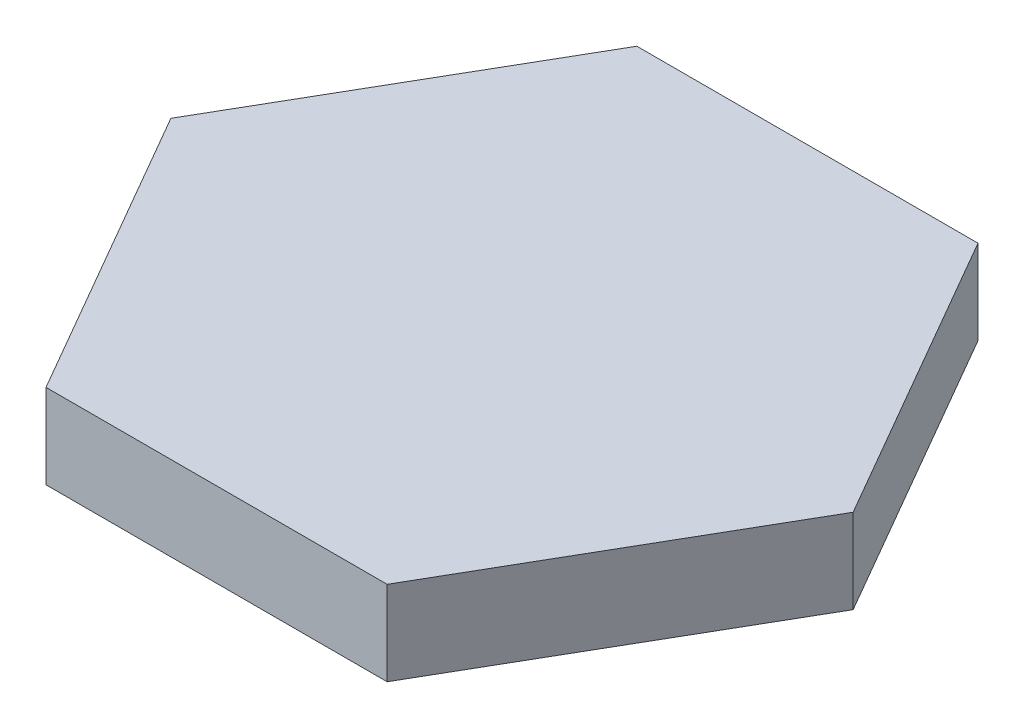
ISO-10303-21;
HEADER;
FILE_DESCRIPTION(('STEP AP214'),'2;1');
FILE_NAME('part.step','',(''),(''),'','','');
FILE_SCHEMA(('AUTOMOTIVE_DESIGN { 1 0 10303 214 1 1 1 1 }'));
ENDSEC;
DATA;
#1=APPLICATION_CONTEXT('core data for automotive mechanical design processes');
#2=APPLICATION_PROTOCOL_DEFINITION('international standard','automotive_design',2000,#1);
#3=PRODUCT_CONTEXT('',#1,'mechanical');
#4=PRODUCT('Part','Part','',(#3));
#5=PRODUCT_RELATED_PRODUCT_CATEGORY('part','',(#4));
#6=PRODUCT_DEFINITION_FORMATION('','',#4);
#7=PRODUCT_DEFINITION_CONTEXT('part definition',#1,'design');
#8=PRODUCT_DEFINITION('design','',#6,#7);
#9=PRODUCT_DEFINITION_SHAPE('','',#8);
#10=(LENGTH_UNIT() NAMED_UNIT(*) SI_UNIT(.MILLI.,.METRE.));
#11=(NAMED_UNIT(*) PLANE_ANGLE_UNIT() SI_UNIT($,.RADIAN.));
#12=(NAMED_UNIT(*) SI_UNIT($,.STERADIAN.) SOLID_ANGLE_UNIT());
#13=UNCERTAINTY_MEASURE_WITH_UNIT(LENGTH_MEASURE(1.E-05),#10,'distance_accuracy_value','');
#14=(GEOMETRIC_REPRESENTATION_CONTEXT(3) GLOBAL_UNCERTAINTY_ASSIGNED_CONTEXT((#13)) GLOBAL_UNIT_ASSIGNED_CONTEXT((#10,
#11,#12)) REPRESENTATION_CONTEXT('',''));
#15=CARTESIAN_POINT('',(0.,0.,0.));
#16=DIRECTION('',(0.,0.,1.));
#17=DIRECTION('',(1.,0.,0.));
#18=AXIS2_PLACEMENT_3D('',#15,#16,#17);
#19=CARTESIAN_POINT('',(-20.2072594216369,10.,35.));
#20=DIRECTION('',(0.,0.,-1.));
#21=DIRECTION('',(-1.,0.,0.));
#22=AXIS2_PLACEMENT_3D('',#19,#20,#21);
#23=PLANE('',#22);
#24=DIRECTION('',(1.,0.,0.));
#25=VECTOR('',#24,1.);
#26=CARTESIAN_POINT('',(-20.2072594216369,0.,35.));
#27=LINE('',#26,#25);
#28=CARTESIAN_POINT('',(-20.2072594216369,0.,35.));
#29=VERTEX_POINT('',#28);
#30=CARTESIAN_POINT('',(20.2072594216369,0.,35.));
#31=VERTEX_POINT('',#30);
#32=EDGE_CURVE('E116',#29,#31,#27,.T.);
#33=ORIENTED_EDGE('',*,*,#32,.T.);
#34=DIRECTION('',(0.,-1.,0.));
#35=VECTOR('',#34,1.);
#36=CARTESIAN_POINT('',(20.2072594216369,10.,35.));
#37=LINE('',#36,#35);
#38=CARTESIAN_POINT('',(20.2072594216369,10.,35.));
#39=VERTEX_POINT('',#38);
#40=EDGE_CURVE('E11',#39,#31,#37,.T.);
#41=ORIENTED_EDGE('',*,*,#40,.F.);
#42=DIRECTION('',(1.,0.,0.));
#43=VECTOR('',#42,1.);
#44=CARTESIAN_POINT('',(-20.2072594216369,10.,35.));
#45=LINE('',#44,#43);
#46=CARTESIAN_POINT('',(-20.2072594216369,10.,35.));
#47=VERTEX_POINT('',#46);
#48=EDGE_CURVE('E126',#47,#39,#45,.T.);
#49=ORIENTED_EDGE('',*,*,#48,.F.);
#50=DIRECTION('',(0.,-1.,0.));
#51=VECTOR('',#50,1.);
#52=CARTESIAN_POINT('',(-20.2072594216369,10.,35.));
#53=LINE('',#52,#51);
#54=EDGE_CURVE('E112',#47,#29,#53,.T.);
#55=ORIENTED_EDGE('',*,*,#54,.T.);
#56=EDGE_LOOP('',(#33,#41,#49,#55));
#57=FACE_BOUND('',#56,.T.);
#58=ADVANCED_FACE('F32',(#57),#23,.F.);
#59=CARTESIAN_POINT('',(20.2072594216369,10.,35.));
#60=DIRECTION('',(-0.866025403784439,0.,-0.5));
#61=DIRECTION('',(-0.5,0.,0.866025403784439));
#62=AXIS2_PLACEMENT_3D('',#59,#60,#61);
#63=PLANE('',#62);
#64=DIRECTION('',(0.5,0.,-0.866025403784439));
#65=VECTOR('',#64,1.);
#66=CARTESIAN_POINT('',(20.2072594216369,0.,35.));
#67=LINE('',#66,#65);
#68=CARTESIAN_POINT('',(40.4145188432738,0.,0.));
#69=VERTEX_POINT('',#68);
#70=EDGE_CURVE('E119',#31,#69,#67,.T.);
#71=ORIENTED_EDGE('',*,*,#70,.T.);
#72=DIRECTION('',(0.,-1.,0.));
#73=VECTOR('',#72,1.);
#74=CARTESIAN_POINT('',(40.4145188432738,10.,0.));
#75=LINE('',#74,#73);
#76=CARTESIAN_POINT('',(40.4145188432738,10.,0.));
#77=VERTEX_POINT('',#76);
#78=EDGE_CURVE('E40',#77,#69,#75,.T.);
#79=ORIENTED_EDGE('',*,*,#78,.F.);
#80=DIRECTION('',(0.5,0.,-0.866025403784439));
#81=VECTOR('',#80,1.);
#82=CARTESIAN_POINT('',(20.2072594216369,10.,35.));
#83=LINE('',#82,#81);
#84=EDGE_CURVE('E85',#39,#77,#83,.T.);
#85=ORIENTED_EDGE('',*,*,#84,.F.);
#86=ORIENTED_EDGE('',*,*,#40,.T.);
#87=EDGE_LOOP('',(#71,#79,#85,#86));
#88=FACE_BOUND('',#87,.T.);
#89=ADVANCED_FACE('F150',(#88),#63,.F.);
#90=CARTESIAN_POINT('',(40.4145188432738,10.,0.));
#91=DIRECTION('',(-0.866025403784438,0.,0.5));
#92=DIRECTION('',(0.5,0.,0.866025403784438));
#93=AXIS2_PLACEMENT_3D('',#90,#91,#92);
#94=PLANE('',#93);
#95=DIRECTION('',(-0.5,0.,-0.866025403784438));
#96=VECTOR('',#95,1.);
#97=CARTESIAN_POINT('',(40.4145188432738,0.,0.));
#98=LINE('',#97,#96);
#99=CARTESIAN_POINT('',(20.2072594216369,0.,-35.));
#100=VERTEX_POINT('',#99);
#101=EDGE_CURVE('E121',#69,#100,#98,.T.);
#102=ORIENTED_EDGE('',*,*,#101,.T.);
#103=DIRECTION('',(0.,-1.,0.));
#104=VECTOR('',#103,1.);
#105=CARTESIAN_POINT('',(20.2072594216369,10.,-35.));
#106=LINE('',#105,#104);
#107=CARTESIAN_POINT('',(20.2072594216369,10.,-35.));
#108=VERTEX_POINT('',#107);
#109=EDGE_CURVE('E107',#108,#100,#106,.T.);
#110=ORIENTED_EDGE('',*,*,#109,.F.);
#111=DIRECTION('',(-0.5,0.,-0.866025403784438));
#112=VECTOR('',#111,1.);
#113=CARTESIAN_POINT('',(40.4145188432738,10.,0.));
#114=LINE('',#113,#112);
#115=EDGE_CURVE('E98',#77,#108,#114,.T.);
#116=ORIENTED_EDGE('',*,*,#115,.F.);
#117=ORIENTED_EDGE('',*,*,#78,.T.);
#118=EDGE_LOOP('',(#102,#110,#116,#117));
#119=FACE_BOUND('',#118,.T.);
#120=ADVANCED_FACE('F132',(#119),#94,.F.);
#121=CARTESIAN_POINT('',(20.2072594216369,10.,-35.));
#122=DIRECTION('',(0.,0.,1.));
#123=DIRECTION('',(1.,0.,0.));
#124=AXIS2_PLACEMENT_3D('',#121,#122,#123);
#125=PLANE('',#124);
#126=DIRECTION('',(-1.,0.,0.));
#127=VECTOR('',#126,1.);
#128=CARTESIAN_POINT('',(20.2072594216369,0.,-35.));
#129=LINE('',#128,#127);
#130=CARTESIAN_POINT('',(-20.2072594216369,0.,-35.));
#131=VERTEX_POINT('',#130);
#132=EDGE_CURVE('E106',#100,#131,#129,.T.);
#133=ORIENTED_EDGE('',*,*,#132,.T.);
#134=DIRECTION('',(0.,-1.,0.));
#135=VECTOR('',#134,1.);
#136=CARTESIAN_POINT('',(-20.2072594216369,10.,-35.));
#137=LINE('',#136,#135);
#138=CARTESIAN_POINT('',(-20.2072594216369,10.,-35.));
#139=VERTEX_POINT('',#138);
#140=EDGE_CURVE('E103',#139,#131,#137,.T.);
#141=ORIENTED_EDGE('',*,*,#140,.F.);
#142=DIRECTION('',(-1.,0.,0.));
#143=VECTOR('',#142,1.);
#144=CARTESIAN_POINT('',(20.2072594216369,10.,-35.));
#145=LINE('',#144,#143);
#146=EDGE_CURVE('E92',#108,#139,#145,.T.);
#147=ORIENTED_EDGE('',*,*,#146,.F.);
#148=ORIENTED_EDGE('',*,*,#109,.T.);
#149=EDGE_LOOP('',(#133,#141,#147,#148));
#150=FACE_BOUND('',#149,.T.);
#151=ADVANCED_FACE('F104',(#150),#125,.F.);
#152=CARTESIAN_POINT('',(-20.2072594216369,10.,-35.));
#153=DIRECTION('',(0.866025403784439,0.,0.5));
#154=DIRECTION('',(0.5,0.,-0.866025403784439));
#155=AXIS2_PLACEMENT_3D('',#152,#153,#154);
#156=PLANE('',#155);
#157=DIRECTION('',(-0.5,0.,0.866025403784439));
#158=VECTOR('',#157,1.);
#159=CARTESIAN_POINT('',(-20.2072594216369,0.,-35.));
#160=LINE('',#159,#158);
#161=CARTESIAN_POINT('',(-40.4145188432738,0.,0.));
#162=VERTEX_POINT('',#161);
#163=EDGE_CURVE('E71',#131,#162,#160,.T.);
#164=ORIENTED_EDGE('',*,*,#163,.T.);
#165=DIRECTION('',(0.,-1.,0.));
#166=VECTOR('',#165,1.);
#167=CARTESIAN_POINT('',(-40.4145188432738,10.,0.));
#168=LINE('',#167,#166);
#169=CARTESIAN_POINT('',(-40.4145188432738,10.,0.));
#170=VERTEX_POINT('',#169);
#171=EDGE_CURVE('E108',#170,#162,#168,.T.);
#172=ORIENTED_EDGE('',*,*,#171,.F.);
#173=DIRECTION('',(-0.5,0.,0.866025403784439));
#174=VECTOR('',#173,1.);
#175=CARTESIAN_POINT('',(-20.2072594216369,10.,-35.));
#176=LINE('',#175,#174);
#177=EDGE_CURVE('E96',#139,#170,#176,.T.);
#178=ORIENTED_EDGE('',*,*,#177,.F.);
#179=ORIENTED_EDGE('',*,*,#140,.T.);
#180=EDGE_LOOP('',(#164,#172,#178,#179));
#181=FACE_BOUND('',#180,.T.);
#182=ADVANCED_FACE('F110',(#181),#156,.F.);
#183=CARTESIAN_POINT('',(-40.4145188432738,10.,0.));
#184=DIRECTION('',(0.866025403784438,0.,-0.5));
#185=DIRECTION('',(-0.5,0.,-0.866025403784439));
#186=AXIS2_PLACEMENT_3D('',#183,#184,#185);
#187=PLANE('',#186);
#188=DIRECTION('',(0.5,0.,0.866025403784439));
#189=VECTOR('',#188,1.);
#190=CARTESIAN_POINT('',(-40.4145188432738,0.,0.));
#191=LINE('',#190,#189);
#192=EDGE_CURVE('E77',#162,#29,#191,.T.);
#193=ORIENTED_EDGE('',*,*,#192,.T.);
#194=ORIENTED_EDGE('',*,*,#54,.F.);
#195=DIRECTION('',(0.5,0.,0.866025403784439));
#196=VECTOR('',#195,1.);
#197=CARTESIAN_POINT('',(-40.4145188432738,10.,0.));
#198=LINE('',#197,#196);
#199=EDGE_CURVE('E48',#170,#47,#198,.T.);
#200=ORIENTED_EDGE('',*,*,#199,.F.);
#201=ORIENTED_EDGE('',*,*,#171,.T.);
#202=EDGE_LOOP('',(#193,#194,#200,#201));
#203=FACE_BOUND('',#202,.T.);
#204=ADVANCED_FACE('F139',(#203),#187,.F.);
#205=CARTESIAN_POINT('',(0.,10.,0.));
#206=DIRECTION('',(0.,1.,0.));
#207=DIRECTION('',(0.,0.,1.));
#208=AXIS2_PLACEMENT_3D('',#205,#206,#207);
#209=PLANE('',#208);
#210=ORIENTED_EDGE('',*,*,#48,.T.);
#211=ORIENTED_EDGE('',*,*,#84,.T.);
#212=ORIENTED_EDGE('',*,*,#115,.T.);
#213=ORIENTED_EDGE('',*,*,#146,.T.);
#214=ORIENTED_EDGE('',*,*,#177,.T.);
#215=ORIENTED_EDGE('',*,*,#199,.T.);
#216=EDGE_LOOP('',(#210,#211,#212,#213,#214,#215));
#217=FACE_BOUND('',#216,.T.);
#218=ADVANCED_FACE('F94',(#217),#209,.T.);
#219=CARTESIAN_POINT('',(0.,0.,0.));
#220=DIRECTION('',(0.,1.,0.));
#221=DIRECTION('',(0.,0.,1.));
#222=AXIS2_PLACEMENT_3D('',#219,#220,#221);
#223=PLANE('',#222);
#224=ORIENTED_EDGE('',*,*,#32,.F.);
#225=ORIENTED_EDGE('',*,*,#192,.F.);
#226=ORIENTED_EDGE('',*,*,#163,.F.);
#227=ORIENTED_EDGE('',*,*,#132,.F.);
#228=ORIENTED_EDGE('',*,*,#101,.F.);
#229=ORIENTED_EDGE('',*,*,#70,.F.);
#230=EDGE_LOOP('',(#224,#225,#226,#227,#228,#229));
#231=FACE_BOUND('',#230,.T.);
#232=ADVANCED_FACE('F135',(#231),#223,.F.);
#233=CLOSED_SHELL('',(#58,#89,#120,#151,#182,#204,#218,#232));
#234=MANIFOLD_SOLID_BREP('B2',#233);
#235=ADVANCED_BREP_SHAPE_REPRESENTATION('',(#18,#234),#14);
#236=SHAPE_DEFINITION_REPRESENTATION(#9,#235);
ENDSEC;
END-ISO-10303-21;
